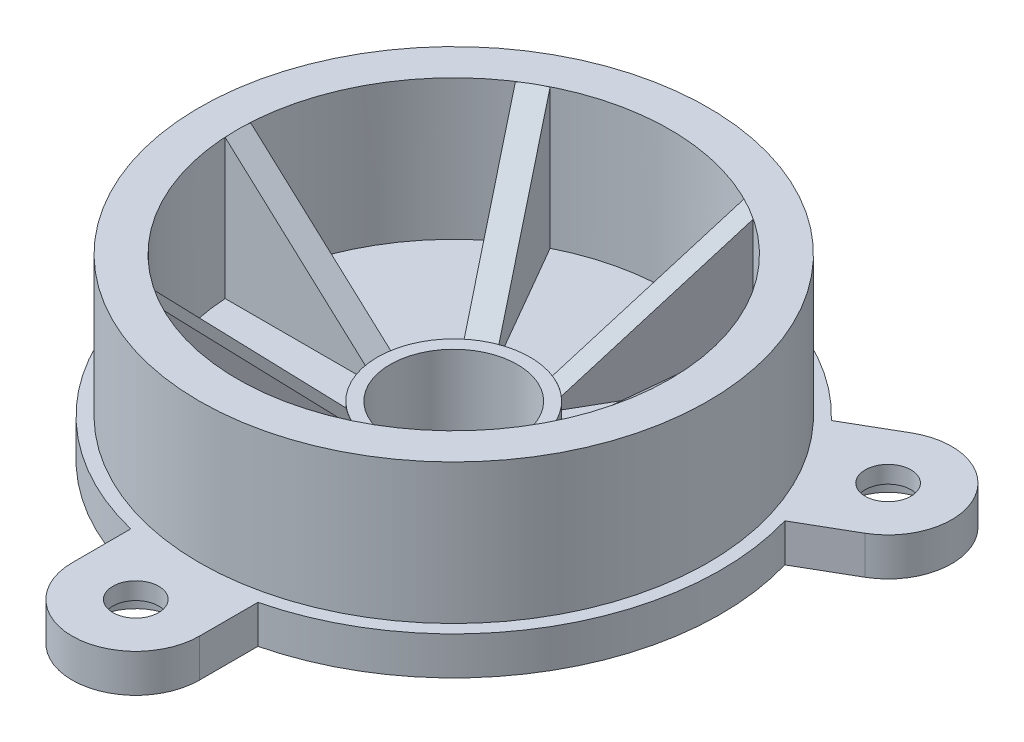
from build123d import *
from build123d.topology import SkipClean

# Parameters (mm, degrees)
BOSS_EXTRUDE1_START             = -3
BOSS_EXTRUDE1_DEPTH             = 3
CBORE_FOR_M3_SBHCS1_D           = 3.6
CBORE_FOR_M3_SBHCS1_CBORE_D     = 6.7
CBORE_FOR_M3_SBHCS1_CBORE_DEPTH = 1.65
CIRPATTERN1_COUNT               = 3
RIB1_REACH                      = 45.2
SKETCH5_WALL_W                  = 103.26644724
SKETCH5_WALL_H                  = 2
CIRPATTERN2_COUNT               = 6


with BuildPart() as part:
    # Sketch1 → Revolve1 (revolve)
    with BuildSketch(Plane(origin=(0, 0, 0), x_dir=(0, 0, -1), z_dir=(1, 0, 0)), mode=Mode.PRIVATE) as revolve1_sk:
        Polygon((5, 0), (5, 6), (6, 6), (6, 5), (17, 5), (17, 16), (20, 16), (20, 5), (21, 5), (21, 2), (10, 2), (10, 0), align=None)
    revolve(revolve1_sk.sketch.rotate(Axis((0, 20.119268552, 0), (0, -1, 0)), 180), axis=Axis((0, 20.119268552, 0), (0, -1, 0)))

    # Sketch2 → Boss-Extrude1 (add)
    with BuildSketch(Plane(origin=(0, 5, 0), x_dir=(1, 0, 0), z_dir=(0, 1, 0)).offset(BOSS_EXTRUDE1_START)):
        with BuildLine():
            Line((-5, -19.364916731), (-5, -25))
            ThreePointArc((-5, -25), (0, -30), (5, -25))
            Line((5, -25), (5, -19.364916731))
            ThreePointArc((5, -19.364916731), (0, -20), (-5, -19.364916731))
        make_face()
    boss_extrude1 = extrude(amount=BOSS_EXTRUDE1_DEPTH)

    # CBORE for M3 SBHCS1 (through all)
    with Locations(Plane.XZ.offset(-2)):
        with Locations((0, 25)):
            cbore_for_m3_sbhcs1 = CounterBoreHole(CBORE_FOR_M3_SBHCS1_D / 2, CBORE_FOR_M3_SBHCS1_CBORE_D / 2, CBORE_FOR_M3_SBHCS1_CBORE_DEPTH)

    # CirPattern1: Boss-Extrude1, CBORE for M3 SBHCS1 ×3 about axis
    cirpattern1_axis = Axis((0, 0, 0), (0, 1, 0))
    add([boss_extrude1.rotate(cirpattern1_axis, i * 360 / CIRPATTERN1_COUNT) for i in range(1, CIRPATTERN1_COUNT)])
    add([cbore_for_m3_sbhcs1.rotate(cirpattern1_axis, i * 360 / CIRPATTERN1_COUNT) for i in range(1, CIRPATTERN1_COUNT)], mode=Mode.SUBTRACT)

    # Sketch5 wall → Rib1 (add, up to next)
    with BuildSketch(Plane(origin=(-11.5, 11, 0), x_dir=(-0.739940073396, 0.672672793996, 0), z_dir=(-0.672672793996, -0.739940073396, 0)), mode=Mode.PRIVATE) as rib1_sk1:
        Rectangle(SKETCH5_WALL_W, SKETCH5_WALL_H)
    rib1_tool1 = extrude(rib1_sk1.sketch, amount=RIB1_REACH, mode=Mode.PRIVATE) - part.part
    rib1 = rib1_tool1.solids().sort_by_distance((-11.5, 11, 0))[0]
    add(rib1)

    # CirPattern2: Rib1 ×6 about axis
    with SkipClean():  # the faces are left unmerged after this step: merging them gives an invalid solid
        cirpattern2_axis = Axis((0, 0, 0), (0, 1, 0))
        for i in range(1, CIRPATTERN2_COUNT):
            add(rib1.rotate(cirpattern2_axis, i * 360 / CIRPATTERN2_COUNT))


solid = part.part
